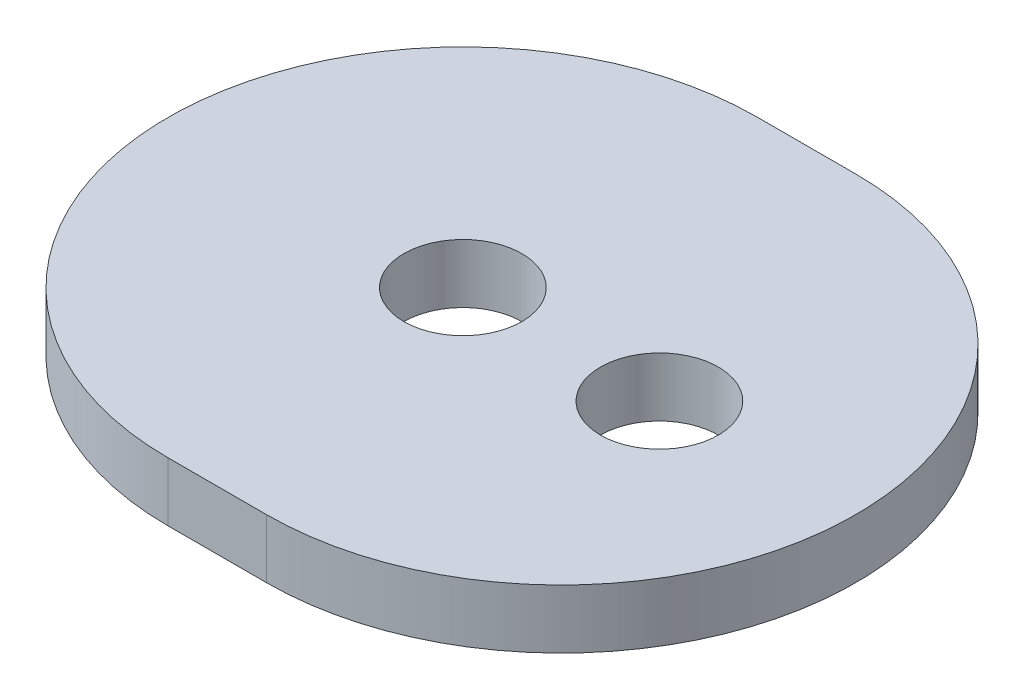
from build123d import *

# Parameters (mm, degrees)
SKETCH1_R      = 3
EXTRUDE1_DEPTH = 3


with BuildPart() as part:
    # Sketch1 → Extrude1 (new body)
    with BuildSketch(Plane(origin=(0, 0, 0), x_dir=(1, 0, 0), z_dir=(0, 1, 0))):
        with BuildLine():
            Line((5, -15), (0, -15))
            ThreePointArc((0, -15), (-15, 0), (0, 15))
            Line((0, 15), (5, 15))
            ThreePointArc((5, 15), (20, 0), (5, -15))
        make_face()
        with Locations(Location((10, 0, 0), (0, 0, 270))):
            Circle(SKETCH1_R, mode=Mode.SUBTRACT)
        with Locations(Location((0, 0, 0), (0, 0, 270))):
            Circle(SKETCH1_R, mode=Mode.SUBTRACT)
    extrude(amount=EXTRUDE1_DEPTH)


solid = part.part
